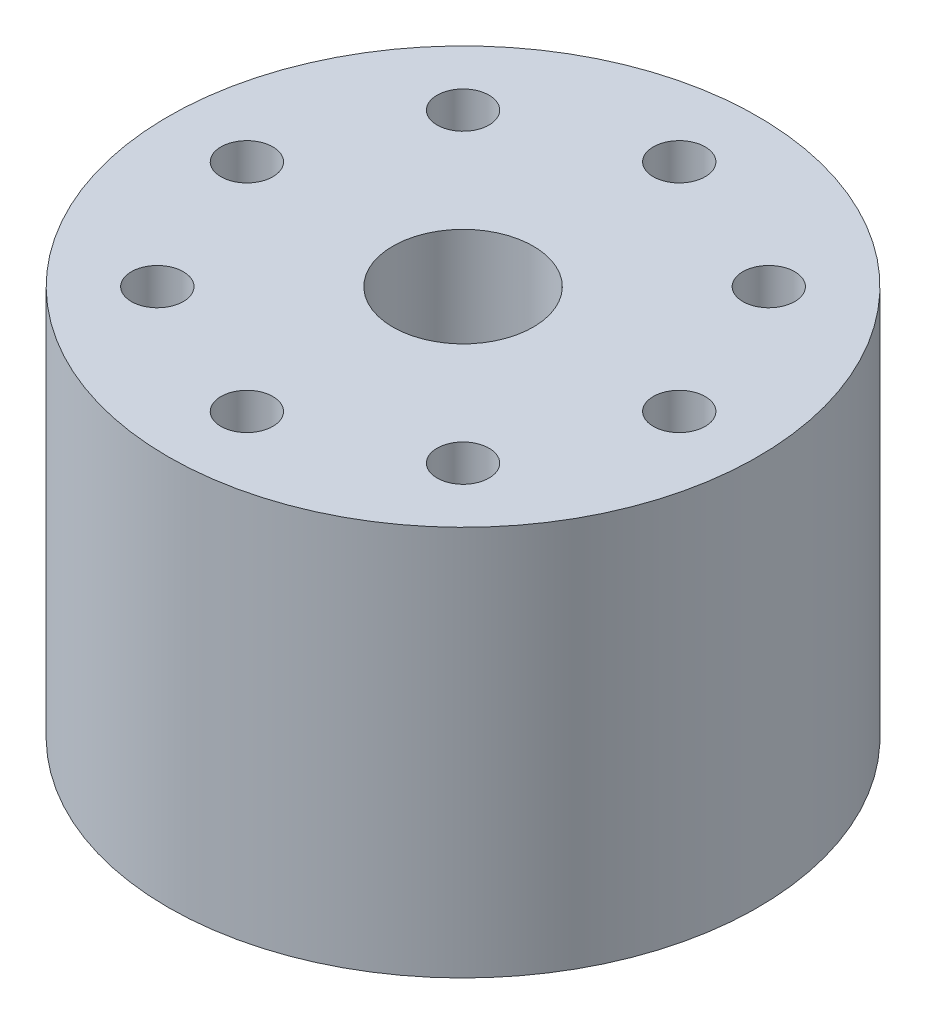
ISO-10303-21;
HEADER;
FILE_DESCRIPTION(('STEP AP214'),'2;1');
FILE_NAME('part.step','',(''),(''),'','','');
FILE_SCHEMA(('AUTOMOTIVE_DESIGN { 1 0 10303 214 1 1 1 1 }'));
ENDSEC;
DATA;
#1=APPLICATION_CONTEXT('core data for automotive mechanical design processes');
#2=APPLICATION_PROTOCOL_DEFINITION('international standard','automotive_design',2000,#1);
#3=PRODUCT_CONTEXT('',#1,'mechanical');
#4=PRODUCT('Part','Part','',(#3));
#5=PRODUCT_RELATED_PRODUCT_CATEGORY('part','',(#4));
#6=PRODUCT_DEFINITION_FORMATION('','',#4);
#7=PRODUCT_DEFINITION_CONTEXT('part definition',#1,'design');
#8=PRODUCT_DEFINITION('design','',#6,#7);
#9=PRODUCT_DEFINITION_SHAPE('','',#8);
#10=(LENGTH_UNIT() NAMED_UNIT(*) SI_UNIT(.MILLI.,.METRE.));
#11=(NAMED_UNIT(*) PLANE_ANGLE_UNIT() SI_UNIT($,.RADIAN.));
#12=(NAMED_UNIT(*) SI_UNIT($,.STERADIAN.) SOLID_ANGLE_UNIT());
#13=UNCERTAINTY_MEASURE_WITH_UNIT(LENGTH_MEASURE(1.E-05),#10,'distance_accuracy_value','');
#14=(GEOMETRIC_REPRESENTATION_CONTEXT(3) GLOBAL_UNCERTAINTY_ASSIGNED_CONTEXT((#13)) GLOBAL_UNIT_ASSIGNED_CONTEXT((#10,
#11,#12)) REPRESENTATION_CONTEXT('',''));
#15=CARTESIAN_POINT('',(0.,0.,0.));
#16=DIRECTION('',(0.,0.,1.));
#17=DIRECTION('',(1.,0.,0.));
#18=AXIS2_PLACEMENT_3D('',#15,#16,#17);
#19=CARTESIAN_POINT('',(0.,49.65,0.));
#20=DIRECTION('',(0.,-1.,0.));
#21=DIRECTION('',(0.,0.,-1.));
#22=AXIS2_PLACEMENT_3D('',#19,#20,#21);
#23=CYLINDRICAL_SURFACE('',#22,37.5);
#24=CARTESIAN_POINT('',(0.,49.65,0.));
#25=DIRECTION('',(0.,1.,0.));
#26=DIRECTION('',(0.,0.,1.));
#27=AXIS2_PLACEMENT_3D('',#24,#25,#26);
#28=CIRCLE('',#27,37.5);
#29=CARTESIAN_POINT('',(0.,49.65,37.5));
#30=VERTEX_POINT('',#29);
#31=EDGE_CURVE('E54',#30,#30,#28,.T.);
#32=ORIENTED_EDGE('',*,*,#31,.F.);
#33=EDGE_LOOP('',(#32));
#34=FACE_BOUND('',#33,.T.);
#35=CARTESIAN_POINT('',(0.,0.,0.));
#36=DIRECTION('',(0.,1.,0.));
#37=DIRECTION('',(0.,0.,1.));
#38=AXIS2_PLACEMENT_3D('',#35,#36,#37);
#39=CIRCLE('',#38,37.5);
#40=CARTESIAN_POINT('',(0.,0.,37.5));
#41=VERTEX_POINT('',#40);
#42=EDGE_CURVE('E58',#41,#41,#39,.T.);
#43=ORIENTED_EDGE('',*,*,#42,.T.);
#44=EDGE_LOOP('',(#43));
#45=FACE_BOUND('',#44,.T.);
#46=ADVANCED_FACE('F43',(#34,#45),#23,.T.);
#47=CARTESIAN_POINT('',(0.,49.65,0.));
#48=DIRECTION('',(0.,1.,0.));
#49=DIRECTION('',(0.,0.,1.));
#50=AXIS2_PLACEMENT_3D('',#47,#48,#49);
#51=PLANE('',#50);
#52=CARTESIAN_POINT('',(0.,49.65,27.5));
#53=DIRECTION('',(0.,1.,0.));
#54=DIRECTION('',(0.,0.,1.));
#55=AXIS2_PLACEMENT_3D('',#52,#53,#54);
#56=CIRCLE('',#55,3.3);
#57=CARTESIAN_POINT('',(0.,49.65,30.8));
#58=VERTEX_POINT('',#57);
#59=EDGE_CURVE('E263',#58,#58,#56,.T.);
#60=ORIENTED_EDGE('',*,*,#59,.F.);
#61=EDGE_LOOP('',(#60));
#62=FACE_BOUND('',#61,.T.);
#63=CARTESIAN_POINT('',(-19.4454364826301,49.65,19.44543648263));
#64=DIRECTION('',(0.,1.,0.));
#65=DIRECTION('',(0.,0.,1.));
#66=AXIS2_PLACEMENT_3D('',#63,#64,#65);
#67=CIRCLE('',#66,3.3);
#68=CARTESIAN_POINT('',(-19.4454364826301,49.65,22.74543648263));
#69=VERTEX_POINT('',#68);
#70=EDGE_CURVE('E268',#69,#69,#67,.T.);
#71=ORIENTED_EDGE('',*,*,#70,.F.);
#72=EDGE_LOOP('',(#71));
#73=FACE_BOUND('',#72,.T.);
#74=CARTESIAN_POINT('',(-27.5,49.65,0.));
#75=DIRECTION('',(0.,1.,0.));
#76=DIRECTION('',(0.,0.,1.));
#77=AXIS2_PLACEMENT_3D('',#74,#75,#76);
#78=CIRCLE('',#77,3.3);
#79=CARTESIAN_POINT('',(-27.5,49.65,3.2999999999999));
#80=VERTEX_POINT('',#79);
#81=EDGE_CURVE('E279',#80,#80,#78,.T.);
#82=ORIENTED_EDGE('',*,*,#81,.F.);
#83=EDGE_LOOP('',(#82));
#84=FACE_BOUND('',#83,.T.);
#85=CARTESIAN_POINT('',(-19.44543648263,49.65,-19.4454364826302));
#86=DIRECTION('',(0.,1.,0.));
#87=DIRECTION('',(0.,0.,1.));
#88=AXIS2_PLACEMENT_3D('',#85,#86,#87);
#89=CIRCLE('',#88,3.3);
#90=CARTESIAN_POINT('',(-19.44543648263,49.65,-16.1454364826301));
#91=VERTEX_POINT('',#90);
#92=EDGE_CURVE('E285',#91,#91,#89,.T.);
#93=ORIENTED_EDGE('',*,*,#92,.F.);
#94=EDGE_LOOP('',(#93));
#95=FACE_BOUND('',#94,.T.);
#96=CARTESIAN_POINT('',(1.92031473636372E-13,49.65,-27.5));
#97=DIRECTION('',(0.,1.,0.));
#98=DIRECTION('',(0.,0.,1.));
#99=AXIS2_PLACEMENT_3D('',#96,#97,#98);
#100=CIRCLE('',#99,3.3);
#101=CARTESIAN_POINT('',(1.92031473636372E-13,49.65,-24.2));
#102=VERTEX_POINT('',#101);
#103=EDGE_CURVE('E291',#102,#102,#100,.T.);
#104=ORIENTED_EDGE('',*,*,#103,.F.);
#105=EDGE_LOOP('',(#104));
#106=FACE_BOUND('',#105,.T.);
#107=CARTESIAN_POINT('',(19.4454364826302,49.65,-19.4454364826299));
#108=DIRECTION('',(0.,1.,0.));
#109=DIRECTION('',(0.,0.,1.));
#110=AXIS2_PLACEMENT_3D('',#107,#108,#109);
#111=CIRCLE('',#110,3.3);
#112=CARTESIAN_POINT('',(19.4454364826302,49.65,-16.1454364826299));
#113=VERTEX_POINT('',#112);
#114=EDGE_CURVE('E316',#113,#113,#111,.T.);
#115=ORIENTED_EDGE('',*,*,#114,.F.);
#116=EDGE_LOOP('',(#115));
#117=FACE_BOUND('',#116,.T.);
#118=CARTESIAN_POINT('',(27.5,49.65,2.88047210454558E-13));
#119=DIRECTION('',(0.,1.,0.));
#120=DIRECTION('',(0.,0.,1.));
#121=AXIS2_PLACEMENT_3D('',#118,#119,#120);
#122=CIRCLE('',#121,3.3);
#123=CARTESIAN_POINT('',(27.5,49.65,3.30000000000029));
#124=VERTEX_POINT('',#123);
#125=EDGE_CURVE('E323',#124,#124,#122,.T.);
#126=ORIENTED_EDGE('',*,*,#125,.F.);
#127=EDGE_LOOP('',(#126));
#128=FACE_BOUND('',#127,.T.);
#129=CARTESIAN_POINT('',(19.4454364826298,49.65,19.4454364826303));
#130=DIRECTION('',(0.,1.,0.));
#131=DIRECTION('',(0.,0.,1.));
#132=AXIS2_PLACEMENT_3D('',#129,#130,#131);
#133=CIRCLE('',#132,3.3);
#134=CARTESIAN_POINT('',(19.4454364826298,49.65,22.7454364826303));
#135=VERTEX_POINT('',#134);
#136=EDGE_CURVE('E264',#135,#135,#133,.T.);
#137=ORIENTED_EDGE('',*,*,#136,.F.);
#138=EDGE_LOOP('',(#137));
#139=FACE_BOUND('',#138,.T.);
#140=CARTESIAN_POINT('',(0.,49.65,0.));
#141=DIRECTION('',(0.,1.,0.));
#142=DIRECTION('',(0.,0.,1.));
#143=AXIS2_PLACEMENT_3D('',#140,#141,#142);
#144=CIRCLE('',#143,8.93);
#145=CARTESIAN_POINT('',(0.,49.65,8.93));
#146=VERTEX_POINT('',#145);
#147=EDGE_CURVE('E62',#146,#146,#144,.T.);
#148=ORIENTED_EDGE('',*,*,#147,.F.);
#149=EDGE_LOOP('',(#148));
#150=FACE_BOUND('',#149,.T.);
#151=ORIENTED_EDGE('',*,*,#31,.T.);
#152=EDGE_LOOP('',(#151));
#153=FACE_BOUND('',#152,.T.);
#154=ADVANCED_FACE('F104',(#62,#73,#84,#95,#106,#117,#128,#139,#150,#153),#51,.T.);
#155=CARTESIAN_POINT('',(0.,0.,0.));
#156=DIRECTION('',(0.,1.,0.));
#157=DIRECTION('',(0.,0.,1.));
#158=AXIS2_PLACEMENT_3D('',#155,#156,#157);
#159=PLANE('',#158);
#160=CARTESIAN_POINT('',(0.,0.,27.5));
#161=DIRECTION('',(0.,1.,0.));
#162=DIRECTION('',(0.,0.,1.));
#163=AXIS2_PLACEMENT_3D('',#160,#161,#162);
#164=CIRCLE('',#163,3.3);
#165=CARTESIAN_POINT('',(0.,0.,30.8));
#166=VERTEX_POINT('',#165);
#167=EDGE_CURVE('E260',#166,#166,#164,.T.);
#168=ORIENTED_EDGE('',*,*,#167,.T.);
#169=EDGE_LOOP('',(#168));
#170=FACE_BOUND('',#169,.T.);
#171=CARTESIAN_POINT('',(-19.4454364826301,0.,19.44543648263));
#172=DIRECTION('',(0.,1.,0.));
#173=DIRECTION('',(0.,0.,1.));
#174=AXIS2_PLACEMENT_3D('',#171,#172,#173);
#175=CIRCLE('',#174,3.3);
#176=CARTESIAN_POINT('',(-19.4454364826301,0.,22.74543648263));
#177=VERTEX_POINT('',#176);
#178=EDGE_CURVE('E276',#177,#177,#175,.T.);
#179=ORIENTED_EDGE('',*,*,#178,.T.);
#180=EDGE_LOOP('',(#179));
#181=FACE_BOUND('',#180,.T.);
#182=CARTESIAN_POINT('',(-27.5,0.,0.));
#183=DIRECTION('',(0.,1.,0.));
#184=DIRECTION('',(0.,0.,1.));
#185=AXIS2_PLACEMENT_3D('',#182,#183,#184);
#186=CIRCLE('',#185,3.3);
#187=CARTESIAN_POINT('',(-27.5,0.,3.2999999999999));
#188=VERTEX_POINT('',#187);
#189=EDGE_CURVE('E282',#188,#188,#186,.T.);
#190=ORIENTED_EDGE('',*,*,#189,.T.);
#191=EDGE_LOOP('',(#190));
#192=FACE_BOUND('',#191,.T.);
#193=CARTESIAN_POINT('',(-19.44543648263,0.,-19.4454364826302));
#194=DIRECTION('',(0.,1.,0.));
#195=DIRECTION('',(0.,0.,1.));
#196=AXIS2_PLACEMENT_3D('',#193,#194,#195);
#197=CIRCLE('',#196,3.3);
#198=CARTESIAN_POINT('',(-19.44543648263,0.,-16.1454364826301));
#199=VERTEX_POINT('',#198);
#200=EDGE_CURVE('E288',#199,#199,#197,.T.);
#201=ORIENTED_EDGE('',*,*,#200,.T.);
#202=EDGE_LOOP('',(#201));
#203=FACE_BOUND('',#202,.T.);
#204=CARTESIAN_POINT('',(1.92031473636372E-13,0.,-27.5));
#205=DIRECTION('',(0.,1.,0.));
#206=DIRECTION('',(0.,0.,1.));
#207=AXIS2_PLACEMENT_3D('',#204,#205,#206);
#208=CIRCLE('',#207,3.3);
#209=CARTESIAN_POINT('',(1.92031473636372E-13,0.,-24.2));
#210=VERTEX_POINT('',#209);
#211=EDGE_CURVE('E311',#210,#210,#208,.T.);
#212=ORIENTED_EDGE('',*,*,#211,.T.);
#213=EDGE_LOOP('',(#212));
#214=FACE_BOUND('',#213,.T.);
#215=CARTESIAN_POINT('',(19.4454364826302,0.,-19.4454364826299));
#216=DIRECTION('',(0.,1.,0.));
#217=DIRECTION('',(0.,0.,1.));
#218=AXIS2_PLACEMENT_3D('',#215,#216,#217);
#219=CIRCLE('',#218,3.3);
#220=CARTESIAN_POINT('',(19.4454364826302,0.,-16.1454364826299));
#221=VERTEX_POINT('',#220);
#222=EDGE_CURVE('E321',#221,#221,#219,.T.);
#223=ORIENTED_EDGE('',*,*,#222,.T.);
#224=EDGE_LOOP('',(#223));
#225=FACE_BOUND('',#224,.T.);
#226=CARTESIAN_POINT('',(27.5,0.,2.88047210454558E-13));
#227=DIRECTION('',(0.,1.,0.));
#228=DIRECTION('',(0.,0.,1.));
#229=AXIS2_PLACEMENT_3D('',#226,#227,#228);
#230=CIRCLE('',#229,3.3);
#231=CARTESIAN_POINT('',(27.5,0.,3.30000000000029));
#232=VERTEX_POINT('',#231);
#233=EDGE_CURVE('E271',#232,#232,#230,.T.);
#234=ORIENTED_EDGE('',*,*,#233,.T.);
#235=EDGE_LOOP('',(#234));
#236=FACE_BOUND('',#235,.T.);
#237=CARTESIAN_POINT('',(19.4454364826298,0.,19.4454364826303));
#238=DIRECTION('',(0.,1.,0.));
#239=DIRECTION('',(0.,0.,1.));
#240=AXIS2_PLACEMENT_3D('',#237,#238,#239);
#241=CIRCLE('',#240,3.3);
#242=CARTESIAN_POINT('',(19.4454364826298,0.,22.7454364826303));
#243=VERTEX_POINT('',#242);
#244=EDGE_CURVE('E267',#243,#243,#241,.T.);
#245=ORIENTED_EDGE('',*,*,#244,.T.);
#246=EDGE_LOOP('',(#245));
#247=FACE_BOUND('',#246,.T.);
#248=CARTESIAN_POINT('',(0.,0.,0.));
#249=DIRECTION('',(0.,-1.,0.));
#250=DIRECTION('',(0.,0.,-1.));
#251=AXIS2_PLACEMENT_3D('',#248,#249,#250);
#252=CIRCLE('',#251,11.);
#253=CARTESIAN_POINT('',(0.,0.,-11.));
#254=VERTEX_POINT('',#253);
#255=EDGE_CURVE('E67',#254,#254,#252,.T.);
#256=ORIENTED_EDGE('',*,*,#255,.F.);
#257=EDGE_LOOP('',(#256));
#258=FACE_BOUND('',#257,.T.);
#259=ORIENTED_EDGE('',*,*,#42,.F.);
#260=EDGE_LOOP('',(#259));
#261=FACE_BOUND('',#260,.T.);
#262=ADVANCED_FACE('F103',(#170,#181,#192,#203,#214,#225,#236,#247,#258,#261),#159,.F.);
#263=CARTESIAN_POINT('',(0.,26.65,0.));
#264=DIRECTION('',(0.,1.,0.));
#265=DIRECTION('',(0.,0.,1.));
#266=AXIS2_PLACEMENT_3D('',#263,#264,#265);
#267=CYLINDRICAL_SURFACE('',#266,8.93);
#268=CARTESIAN_POINT('',(0.,26.4576765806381,0.));
#269=DIRECTION('',(0.,1.,0.));
#270=DIRECTION('',(-1.,0.,0.));
#271=AXIS2_PLACEMENT_3D('',#268,#269,#270);
#272=CIRCLE('',#271,8.93);
#273=CARTESIAN_POINT('',(-8.93,26.4576765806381,0.));
#274=VERTEX_POINT('',#273);
#275=EDGE_CURVE('E11',#274,#274,#272,.F.);
#276=ORIENTED_EDGE('',*,*,#275,.T.);
#277=EDGE_LOOP('',(#276));
#278=FACE_BOUND('',#277,.T.);
#279=ORIENTED_EDGE('',*,*,#147,.T.);
#280=EDGE_LOOP('',(#279));
#281=FACE_BOUND('',#280,.T.);
#282=ADVANCED_FACE('F96',(#278,#281),#267,.F.);
#283=CARTESIAN_POINT('',(0.,3.15,0.));
#284=DIRECTION('',(0.,-1.,0.));
#285=DIRECTION('',(0.,0.,-1.));
#286=AXIS2_PLACEMENT_3D('',#283,#284,#285);
#287=PLANE('',#286);
#288=CARTESIAN_POINT('',(0.,3.15,0.));
#289=DIRECTION('',(0.,-1.,0.));
#290=DIRECTION('',(0.,0.,-1.));
#291=AXIS2_PLACEMENT_3D('',#288,#289,#290);
#292=CIRCLE('',#291,11.);
#293=CARTESIAN_POINT('',(0.,3.15,-11.));
#294=VERTEX_POINT('',#293);
#295=EDGE_CURVE('E66',#294,#294,#292,.T.);
#296=ORIENTED_EDGE('',*,*,#295,.T.);
#297=EDGE_LOOP('',(#296));
#298=FACE_BOUND('',#297,.T.);
#299=CARTESIAN_POINT('',(0.,3.15,0.));
#300=DIRECTION('',(0.,-1.,0.));
#301=DIRECTION('',(0.,0.,-1.));
#302=AXIS2_PLACEMENT_3D('',#299,#300,#301);
#303=CIRCLE('',#302,7.);
#304=CARTESIAN_POINT('',(0.,3.15,-7.));
#305=VERTEX_POINT('',#304);
#306=EDGE_CURVE('E70',#305,#305,#303,.T.);
#307=ORIENTED_EDGE('',*,*,#306,.F.);
#308=EDGE_LOOP('',(#307));
#309=FACE_BOUND('',#308,.T.);
#310=ADVANCED_FACE('F93',(#298,#309),#287,.T.);
#311=CARTESIAN_POINT('',(0.,3.15,0.));
#312=DIRECTION('',(0.,-1.,0.));
#313=DIRECTION('',(0.,0.,-1.));
#314=AXIS2_PLACEMENT_3D('',#311,#312,#313);
#315=CYLINDRICAL_SURFACE('',#314,11.);
#316=ORIENTED_EDGE('',*,*,#295,.F.);
#317=EDGE_LOOP('',(#316));
#318=FACE_BOUND('',#317,.T.);
#319=ORIENTED_EDGE('',*,*,#255,.T.);
#320=EDGE_LOOP('',(#319));
#321=FACE_BOUND('',#320,.T.);
#322=ADVANCED_FACE('F90',(#318,#321),#315,.F.);
#323=CARTESIAN_POINT('',(-7.,13.09,0.));
#324=CARTESIAN_POINT('',(-11.2,8.12,0.));
#325=CARTESIAN_POINT('',(-7.,3.15,0.));
#326=B_SPLINE_CURVE_WITH_KNOTS('',2,(#323,#324,#325),.UNSPECIFIED.,.F.,.F.,(3,3),(0.,1.),.UNSPECIFIED.);
#327=CARTESIAN_POINT('',(0.,3.15,0.));
#328=DIRECTION('',(0.,-1.,0.));
#329=AXIS1_PLACEMENT('',#327,#328);
#330=SURFACE_OF_REVOLUTION('',#326,#329);
#331=ORIENTED_EDGE('',*,*,#306,.T.);
#332=EDGE_LOOP('',(#331));
#333=FACE_BOUND('',#332,.T.);
#334=CARTESIAN_POINT('',(0.,13.09,0.));
#335=DIRECTION('',(0.,1.,0.));
#336=DIRECTION('',(-1.,0.,0.));
#337=AXIS2_PLACEMENT_3D('',#334,#335,#336);
#338=CIRCLE('',#337,7.);
#339=CARTESIAN_POINT('',(-7.,13.09,0.));
#340=VERTEX_POINT('',#339);
#341=EDGE_CURVE('E75',#340,#340,#338,.T.);
#342=ORIENTED_EDGE('',*,*,#341,.T.);
#343=EDGE_LOOP('',(#342));
#344=FACE_BOUND('',#343,.T.);
#345=ADVANCED_FACE('F85',(#333,#344),#330,.F.);
#346=CARTESIAN_POINT('',(0.,26.65,0.));
#347=DIRECTION('',(0.,1.,0.));
#348=DIRECTION('',(-1.,0.,0.));
#349=AXIS2_PLACEMENT_3D('',#346,#347,#348);
#350=CYLINDRICAL_SURFACE('',#349,7.);
#351=CARTESIAN_POINT('',(0.,21.1550451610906,0.));
#352=DIRECTION('',(0.,1.,0.));
#353=DIRECTION('',(-1.,0.,0.));
#354=AXIS2_PLACEMENT_3D('',#351,#352,#353);
#355=CIRCLE('',#354,7.);
#356=CARTESIAN_POINT('',(-7.,21.1550451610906,0.));
#357=VERTEX_POINT('',#356);
#358=EDGE_CURVE('E50',#357,#357,#355,.T.);
#359=ORIENTED_EDGE('',*,*,#358,.T.);
#360=EDGE_LOOP('',(#359));
#361=FACE_BOUND('',#360,.T.);
#362=ORIENTED_EDGE('',*,*,#341,.F.);
#363=EDGE_LOOP('',(#362));
#364=FACE_BOUND('',#363,.T.);
#365=ADVANCED_FACE('F89',(#361,#364),#350,.F.);
#366=CARTESIAN_POINT('',(19.4454364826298,0.,19.4454364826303));
#367=DIRECTION('',(0.,1.,0.));
#368=DIRECTION('',(0.,0.,1.));
#369=AXIS2_PLACEMENT_3D('',#366,#367,#368);
#370=CYLINDRICAL_SURFACE('',#369,3.3);
#371=ORIENTED_EDGE('',*,*,#244,.F.);
#372=EDGE_LOOP('',(#371));
#373=FACE_BOUND('',#372,.T.);
#374=ORIENTED_EDGE('',*,*,#136,.T.);
#375=EDGE_LOOP('',(#374));
#376=FACE_BOUND('',#375,.T.);
#377=ADVANCED_FACE('F151',(#373,#376),#370,.F.);
#378=CARTESIAN_POINT('',(27.5,0.,2.88047210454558E-13));
#379=DIRECTION('',(0.,1.,0.));
#380=DIRECTION('',(0.,0.,1.));
#381=AXIS2_PLACEMENT_3D('',#378,#379,#380);
#382=CYLINDRICAL_SURFACE('',#381,3.3);
#383=ORIENTED_EDGE('',*,*,#125,.T.);
#384=EDGE_LOOP('',(#383));
#385=FACE_BOUND('',#384,.T.);
#386=ORIENTED_EDGE('',*,*,#233,.F.);
#387=EDGE_LOOP('',(#386));
#388=FACE_BOUND('',#387,.T.);
#389=ADVANCED_FACE('F157',(#385,#388),#382,.F.);
#390=CARTESIAN_POINT('',(19.4454364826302,0.,-19.4454364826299));
#391=DIRECTION('',(0.,1.,0.));
#392=DIRECTION('',(0.,0.,1.));
#393=AXIS2_PLACEMENT_3D('',#390,#391,#392);
#394=CYLINDRICAL_SURFACE('',#393,3.3);
#395=ORIENTED_EDGE('',*,*,#222,.F.);
#396=EDGE_LOOP('',(#395));
#397=FACE_BOUND('',#396,.T.);
#398=ORIENTED_EDGE('',*,*,#114,.T.);
#399=EDGE_LOOP('',(#398));
#400=FACE_BOUND('',#399,.T.);
#401=ADVANCED_FACE('F164',(#397,#400),#394,.F.);
#402=CARTESIAN_POINT('',(1.92031473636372E-13,0.,-27.5));
#403=DIRECTION('',(0.,1.,0.));
#404=DIRECTION('',(0.,0.,1.));
#405=AXIS2_PLACEMENT_3D('',#402,#403,#404);
#406=CYLINDRICAL_SURFACE('',#405,3.3);
#407=ORIENTED_EDGE('',*,*,#211,.F.);
#408=EDGE_LOOP('',(#407));
#409=FACE_BOUND('',#408,.T.);
#410=ORIENTED_EDGE('',*,*,#103,.T.);
#411=EDGE_LOOP('',(#410));
#412=FACE_BOUND('',#411,.T.);
#413=ADVANCED_FACE('F172',(#409,#412),#406,.F.);
#414=CARTESIAN_POINT('',(-19.44543648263,0.,-19.4454364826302));
#415=DIRECTION('',(0.,1.,0.));
#416=DIRECTION('',(0.,0.,1.));
#417=AXIS2_PLACEMENT_3D('',#414,#415,#416);
#418=CYLINDRICAL_SURFACE('',#417,3.3);
#419=ORIENTED_EDGE('',*,*,#200,.F.);
#420=EDGE_LOOP('',(#419));
#421=FACE_BOUND('',#420,.T.);
#422=ORIENTED_EDGE('',*,*,#92,.T.);
#423=EDGE_LOOP('',(#422));
#424=FACE_BOUND('',#423,.T.);
#425=ADVANCED_FACE('F180',(#421,#424),#418,.F.);
#426=CARTESIAN_POINT('',(-27.5,0.,0.));
#427=DIRECTION('',(0.,1.,0.));
#428=DIRECTION('',(0.,0.,1.));
#429=AXIS2_PLACEMENT_3D('',#426,#427,#428);
#430=CYLINDRICAL_SURFACE('',#429,3.3);
#431=ORIENTED_EDGE('',*,*,#189,.F.);
#432=EDGE_LOOP('',(#431));
#433=FACE_BOUND('',#432,.T.);
#434=ORIENTED_EDGE('',*,*,#81,.T.);
#435=EDGE_LOOP('',(#434));
#436=FACE_BOUND('',#435,.T.);
#437=ADVANCED_FACE('F188',(#433,#436),#430,.F.);
#438=CARTESIAN_POINT('',(-19.4454364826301,0.,19.44543648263));
#439=DIRECTION('',(0.,1.,0.));
#440=DIRECTION('',(0.,0.,1.));
#441=AXIS2_PLACEMENT_3D('',#438,#439,#440);
#442=CYLINDRICAL_SURFACE('',#441,3.3);
#443=ORIENTED_EDGE('',*,*,#178,.F.);
#444=EDGE_LOOP('',(#443));
#445=FACE_BOUND('',#444,.T.);
#446=ORIENTED_EDGE('',*,*,#70,.T.);
#447=EDGE_LOOP('',(#446));
#448=FACE_BOUND('',#447,.T.);
#449=ADVANCED_FACE('F196',(#445,#448),#442,.F.);
#450=CARTESIAN_POINT('',(0.,0.,27.5));
#451=DIRECTION('',(0.,1.,0.));
#452=DIRECTION('',(0.,0.,1.));
#453=AXIS2_PLACEMENT_3D('',#450,#451,#452);
#454=CYLINDRICAL_SURFACE('',#453,3.3);
#455=ORIENTED_EDGE('',*,*,#167,.F.);
#456=EDGE_LOOP('',(#455));
#457=FACE_BOUND('',#456,.T.);
#458=ORIENTED_EDGE('',*,*,#59,.T.);
#459=EDGE_LOOP('',(#458));
#460=FACE_BOUND('',#459,.T.);
#461=ADVANCED_FACE('F204',(#457,#460),#454,.F.);
#462=CARTESIAN_POINT('',(0.,21.1550451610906,0.));
#463=DIRECTION('',(0.,1.,0.));
#464=DIRECTION('',(-1.,0.,0.));
#465=AXIS2_PLACEMENT_3D('',#462,#463,#464);
#466=CONICAL_SURFACE('',#465,7.,0.349065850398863);
#467=ORIENTED_EDGE('',*,*,#275,.F.);
#468=EDGE_LOOP('',(#467));
#469=FACE_BOUND('',#468,.T.);
#470=ORIENTED_EDGE('',*,*,#358,.F.);
#471=EDGE_LOOP('',(#470));
#472=FACE_BOUND('',#471,.T.);
#473=ADVANCED_FACE('F45',(#469,#472),#466,.F.);
#474=CLOSED_SHELL('',(#46,#154,#262,#282,#310,#322,#345,#365,#377,#389,#401,#413,#425,#437,#449,
#461,#473));
#475=MANIFOLD_SOLID_BREP('B2',#474);
#476=ADVANCED_BREP_SHAPE_REPRESENTATION('',(#18,#475),#14);
#477=SHAPE_DEFINITION_REPRESENTATION(#9,#476);
ENDSEC;
END-ISO-10303-21;
